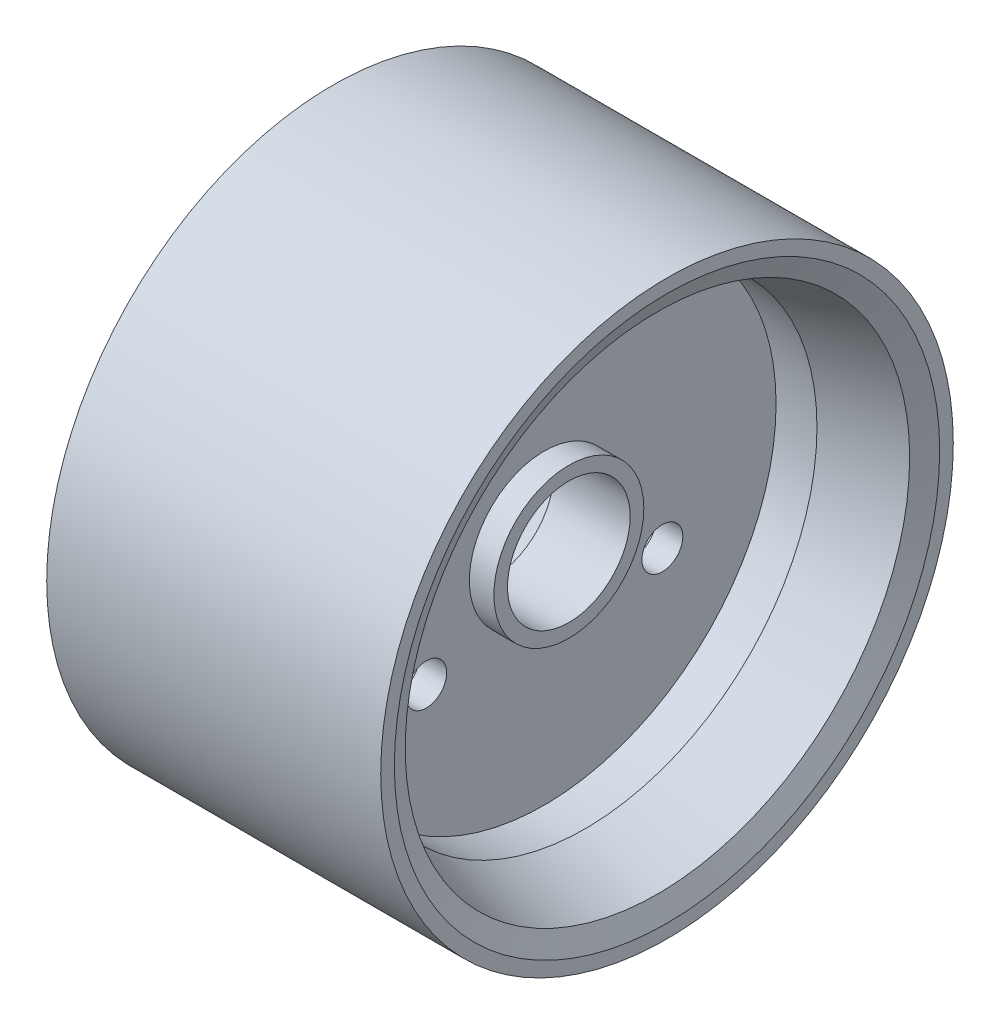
from build123d import *

# Parameters (mm, degrees)
ESQUISSE2_R             = 1.5
ENL_V_MAT_EXTRU_1_DEPTH = 2


with BuildPart() as part:
    # Esquisse1 → R_volution2 (revolve)
    with BuildSketch(Plane.XY, mode=Mode.PRIVATE) as r_volution2_sk:
        Polygon((-3.8, 4.5), (1.8, 4.5), (1.8, 5.5), (0, 5.5), (0, 17), (3, 17), (8.3, 18.5), (9, 20), (9, 21), (-15.5, 21), (-15.5, 20), (-14.8, 18.5), (-9.5, 17), (-2, 17), (-2, 5.5), (-3.8, 5.5), align=None)
    revolve(r_volution2_sk.sketch.rotate(Axis((18.381919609, 0, 0), (-1, 0, 0)), 90), axis=Axis((18.381919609, 0, 0), (-1, 0, 0)))

    # Esquisse2 → Enl_v. mat.-Extru.1 (cut)
    with BuildSketch(Plane(origin=(0, 0, 0), x_dir=(0, 0, -1), z_dir=(1, 0, 0))):
        with Locations((0, 10)):
            Circle(ESQUISSE2_R)
        with Locations((8.660254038, -5)):
            Circle(ESQUISSE2_R)
        with Locations((-8.660254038, -5)):
            Circle(ESQUISSE2_R)
    extrude(amount=-ENL_V_MAT_EXTRU_1_DEPTH, mode=Mode.SUBTRACT)


solid = part.part
